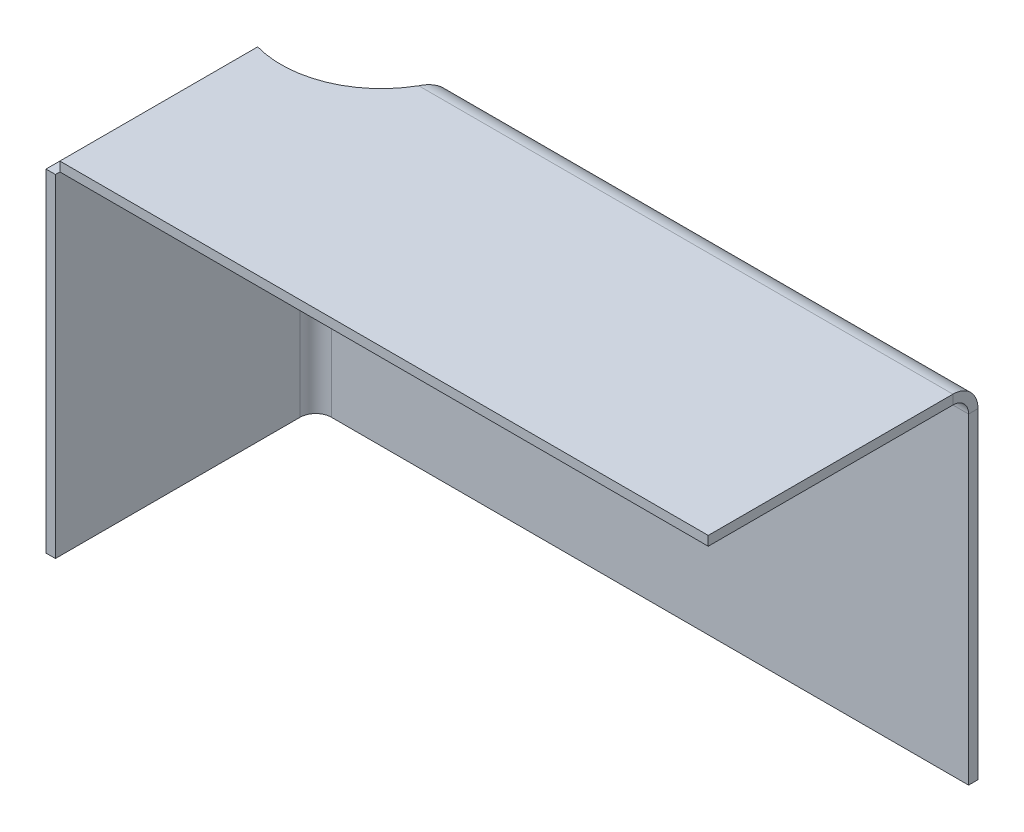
ISO-10303-21;
HEADER;
FILE_DESCRIPTION(('STEP AP214'),'2;1');
FILE_NAME('part.step','',(''),(''),'','','');
FILE_SCHEMA(('AUTOMOTIVE_DESIGN { 1 0 10303 214 1 1 1 1 }'));
ENDSEC;
DATA;
#1=APPLICATION_CONTEXT('core data for automotive mechanical design processes');
#2=APPLICATION_PROTOCOL_DEFINITION('international standard','automotive_design',2000,#1);
#3=PRODUCT_CONTEXT('',#1,'mechanical');
#4=PRODUCT('Part','Part','',(#3));
#5=PRODUCT_RELATED_PRODUCT_CATEGORY('part','',(#4));
#6=PRODUCT_DEFINITION_FORMATION('','',#4);
#7=PRODUCT_DEFINITION_CONTEXT('part definition',#1,'design');
#8=PRODUCT_DEFINITION('design','',#6,#7);
#9=PRODUCT_DEFINITION_SHAPE('','',#8);
#10=(LENGTH_UNIT() NAMED_UNIT(*) SI_UNIT(.MILLI.,.METRE.));
#11=(NAMED_UNIT(*) PLANE_ANGLE_UNIT() SI_UNIT($,.RADIAN.));
#12=(NAMED_UNIT(*) SI_UNIT($,.STERADIAN.) SOLID_ANGLE_UNIT());
#13=UNCERTAINTY_MEASURE_WITH_UNIT(LENGTH_MEASURE(1.E-05),#10,'distance_accuracy_value','');
#14=(GEOMETRIC_REPRESENTATION_CONTEXT(3) GLOBAL_UNCERTAINTY_ASSIGNED_CONTEXT((#13)) GLOBAL_UNIT_ASSIGNED_CONTEXT((#10,
#11,#12)) REPRESENTATION_CONTEXT('',''));
#15=CARTESIAN_POINT('',(0.,0.,0.));
#16=DIRECTION('',(0.,0.,1.));
#17=DIRECTION('',(1.,0.,0.));
#18=AXIS2_PLACEMENT_3D('',#15,#16,#17);
#19=CARTESIAN_POINT('',(52.0320345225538,-26.8636569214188,1.5));
#20=DIRECTION('',(0.,0.,1.));
#21=DIRECTION('',(1.,0.,0.));
#22=AXIS2_PLACEMENT_3D('',#19,#20,#21);
#23=PLANE('',#22);
#24=CARTESIAN_POINT('',(-47.006738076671,21.5302542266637,1.5));
#25=DIRECTION('',(0.,0.,1.));
#26=DIRECTION('',(1.,0.,0.));
#27=AXIS2_PLACEMENT_3D('',#24,#25,#26);
#28=CIRCLE('',#27,16.);
#29=CARTESIAN_POINT('',(-49.5320345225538,5.73079607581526,1.49999996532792));
#30=VERTEX_POINT('',#29);
#31=CARTESIAN_POINT('',(-31.2596167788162,24.3636569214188,1.49999998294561));
#32=VERTEX_POINT('',#31);
#33=EDGE_CURVE('E338',#30,#32,#28,.T.);
#34=ORIENTED_EDGE('',*,*,#33,.F.);
#35=DIRECTION('',(0.,1.,0.));
#36=VECTOR('',#35,1.);
#37=CARTESIAN_POINT('',(-49.5320345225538,-26.8636569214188,1.5));
#38=LINE('',#37,#36);
#39=CARTESIAN_POINT('',(-49.5320345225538,-26.8636569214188,1.49999998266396));
#40=VERTEX_POINT('',#39);
#41=EDGE_CURVE('E461',#40,#30,#38,.T.);
#42=ORIENTED_EDGE('',*,*,#41,.F.);
#43=DIRECTION('',(1.,0.,0.));
#44=VECTOR('',#43,1.);
#45=CARTESIAN_POINT('',(-52.0320345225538,-26.8636569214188,1.5));
#46=LINE('',#45,#44);
#47=CARTESIAN_POINT('',(52.0320345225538,-26.8636569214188,1.5));
#48=VERTEX_POINT('',#47);
#49=EDGE_CURVE('E436',#40,#48,#46,.T.);
#50=ORIENTED_EDGE('',*,*,#49,.T.);
#51=DIRECTION('',(0.,1.,0.));
#52=VECTOR('',#51,1.);
#53=CARTESIAN_POINT('',(52.0320345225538,26.8636569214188,1.5));
#54=LINE('',#53,#52);
#55=CARTESIAN_POINT('',(52.0320345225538,24.3636569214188,1.5));
#56=VERTEX_POINT('',#55);
#57=EDGE_CURVE('E429',#48,#56,#54,.T.);
#58=ORIENTED_EDGE('',*,*,#57,.T.);
#59=DIRECTION('',(1.,0.,0.));
#60=VECTOR('',#59,1.);
#61=CARTESIAN_POINT('',(-51.3249277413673,24.3636569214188,1.5));
#62=LINE('',#61,#60);
#63=EDGE_CURVE('E445',#32,#56,#62,.T.);
#64=ORIENTED_EDGE('',*,*,#63,.F.);
#65=EDGE_LOOP('',(#34,#42,#50,#58,#64));
#66=FACE_BOUND('',#65,.T.);
#67=ADVANCED_FACE('F61',(#66),#23,.T.);
#68=CARTESIAN_POINT('',(52.0320345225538,-26.8636569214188,0.));
#69=DIRECTION('',(0.,0.,1.));
#70=DIRECTION('',(1.,0.,0.));
#71=AXIS2_PLACEMENT_3D('',#68,#69,#70);
#72=PLANE('',#71);
#73=DIRECTION('',(0.,1.,0.));
#74=VECTOR('',#73,1.);
#75=CARTESIAN_POINT('',(-49.5320345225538,-26.8636569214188,0.));
#76=LINE('',#75,#74);
#77=CARTESIAN_POINT('',(-49.5320345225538,-26.8636569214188,0.));
#78=VERTEX_POINT('',#77);
#79=CARTESIAN_POINT('',(-49.5320345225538,5.73079607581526,-3.46720829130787E-08));
#80=VERTEX_POINT('',#79);
#81=EDGE_CURVE('E71',#78,#80,#76,.T.);
#82=ORIENTED_EDGE('',*,*,#81,.T.);
#83=CARTESIAN_POINT('',(-47.006738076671,21.5302542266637,0.));
#84=DIRECTION('',(0.,0.,1.));
#85=DIRECTION('',(1.,0.,0.));
#86=AXIS2_PLACEMENT_3D('',#83,#84,#85);
#87=CIRCLE('',#86,16.);
#88=CARTESIAN_POINT('',(-31.2596167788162,24.3636569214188,0.));
#89=VERTEX_POINT('',#88);
#90=EDGE_CURVE('E85',#80,#89,#87,.T.);
#91=ORIENTED_EDGE('',*,*,#90,.T.);
#92=DIRECTION('',(1.,0.,0.));
#93=VECTOR('',#92,1.);
#94=CARTESIAN_POINT('',(-51.3249277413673,24.3636569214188,0.));
#95=LINE('',#94,#93);
#96=CARTESIAN_POINT('',(52.0320345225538,24.3636569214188,0.));
#97=VERTEX_POINT('',#96);
#98=EDGE_CURVE('E449',#89,#97,#95,.T.);
#99=ORIENTED_EDGE('',*,*,#98,.T.);
#100=DIRECTION('',(0.,1.,0.));
#101=VECTOR('',#100,1.);
#102=CARTESIAN_POINT('',(52.0320345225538,26.8636569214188,0.));
#103=LINE('',#102,#101);
#104=CARTESIAN_POINT('',(52.0320345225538,-26.8636569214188,0.));
#105=VERTEX_POINT('',#104);
#106=EDGE_CURVE('E440',#105,#97,#103,.T.);
#107=ORIENTED_EDGE('',*,*,#106,.F.);
#108=DIRECTION('',(1.,0.,0.));
#109=VECTOR('',#108,1.);
#110=CARTESIAN_POINT('',(-52.0320345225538,-26.8636569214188,0.));
#111=LINE('',#110,#109);
#112=EDGE_CURVE('E437',#78,#105,#111,.T.);
#113=ORIENTED_EDGE('',*,*,#112,.F.);
#114=EDGE_LOOP('',(#82,#91,#99,#107,#113));
#115=FACE_BOUND('',#114,.T.);
#116=ADVANCED_FACE('F515',(#115),#72,.F.);
#117=CARTESIAN_POINT('',(-52.0320345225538,-26.8636569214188,1.5));
#118=DIRECTION('',(0.,1.,0.));
#119=DIRECTION('',(0.,0.,1.));
#120=AXIS2_PLACEMENT_3D('',#117,#118,#119);
#121=PLANE('',#120);
#122=DIRECTION('',(0.,0.,-1.));
#123=VECTOR('',#122,1.);
#124=CARTESIAN_POINT('',(-49.5320345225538,-26.8636569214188,1.5));
#125=LINE('',#124,#123);
#126=EDGE_CURVE('E12',#40,#78,#125,.T.);
#127=ORIENTED_EDGE('',*,*,#126,.T.);
#128=ORIENTED_EDGE('',*,*,#112,.T.);
#129=DIRECTION('',(0.,0.,-1.));
#130=VECTOR('',#129,1.);
#131=CARTESIAN_POINT('',(52.0320345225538,-26.8636569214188,1.5));
#132=LINE('',#131,#130);
#133=EDGE_CURVE('E439',#48,#105,#132,.T.);
#134=ORIENTED_EDGE('',*,*,#133,.F.);
#135=ORIENTED_EDGE('',*,*,#49,.F.);
#136=EDGE_LOOP('',(#127,#128,#134,#135));
#137=FACE_BOUND('',#136,.T.);
#138=ADVANCED_FACE('F520',(#137),#121,.F.);
#139=CARTESIAN_POINT('',(52.0320345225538,26.8636569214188,1.5));
#140=DIRECTION('',(-1.,0.,0.));
#141=DIRECTION('',(0.,0.,1.));
#142=AXIS2_PLACEMENT_3D('',#139,#140,#141);
#143=PLANE('',#142);
#144=DIRECTION('',(0.,0.,-1.));
#145=VECTOR('',#144,1.);
#146=CARTESIAN_POINT('',(52.0320345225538,24.3636569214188,1.5));
#147=LINE('',#146,#145);
#148=EDGE_CURVE('E446',#56,#97,#147,.T.);
#149=ORIENTED_EDGE('',*,*,#148,.F.);
#150=ORIENTED_EDGE('',*,*,#57,.F.);
#151=ORIENTED_EDGE('',*,*,#133,.T.);
#152=ORIENTED_EDGE('',*,*,#106,.T.);
#153=EDGE_LOOP('',(#149,#150,#151,#152));
#154=FACE_BOUND('',#153,.T.);
#155=ADVANCED_FACE('F539',(#154),#143,.F.);
#156=CARTESIAN_POINT('',(-47.006738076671,21.5302542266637,1.5));
#157=DIRECTION('',(0.,0.,1.));
#158=DIRECTION('',(1.,0.,0.));
#159=AXIS2_PLACEMENT_3D('',#156,#157,#158);
#160=CYLINDRICAL_SURFACE('',#159,16.);
#161=CARTESIAN_POINT('',(-49.5320345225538,5.73079607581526,1.49999996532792));
#162=CARTESIAN_POINT('',(-49.5320345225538,5.73079607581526,-3.46720831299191E-08));
#163=B_SPLINE_CURVE_WITH_KNOTS('',1,(#161,#162),.UNSPECIFIED.,.F.,.F.,(2,2),(0.,1.),.UNSPECIFIED.);
#164=EDGE_CURVE('E295',#30,#80,#163,.T.);
#165=ORIENTED_EDGE('',*,*,#164,.F.);
#166=ORIENTED_EDGE('',*,*,#33,.T.);
#167=CARTESIAN_POINT('',(-31.2596167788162,24.3636569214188,-1.70543941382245E-08));
#168=CARTESIAN_POINT('',(-31.2596167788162,24.3636569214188,1.49999998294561));
#169=B_SPLINE_CURVE_WITH_KNOTS('',1,(#167,#168),.UNSPECIFIED.,.F.,.F.,(2,2),(0.,1.),.UNSPECIFIED.);
#170=EDGE_CURVE('E463',#89,#32,#169,.T.);
#171=ORIENTED_EDGE('',*,*,#170,.F.);
#172=ORIENTED_EDGE('',*,*,#90,.F.);
#173=EDGE_LOOP('',(#165,#166,#171,#172));
#174=FACE_BOUND('',#173,.T.);
#175=ADVANCED_FACE('F63',(#174),#160,.F.);
#176=CARTESIAN_POINT('',(-33.1150008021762,28.3636569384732,4.00000000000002));
#177=CARTESIAN_POINT('',(-32.8953184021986,28.3636569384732,3.51950268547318));
#178=CARTESIAN_POINT('',(-32.6913049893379,28.2759946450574,3.02954129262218));
#179=CARTESIAN_POINT('',(-32.4090473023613,28.0078314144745,2.33205620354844));
#180=CARTESIAN_POINT('',(-32.318907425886,27.8958618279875,2.10585699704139));
#181=CARTESIAN_POINT('',(-32.2111651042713,27.7287667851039,1.83665737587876));
#182=CARTESIAN_POINT('',(-32.1898632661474,27.6939957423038,1.78349512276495));
#183=CARTESIAN_POINT('',(-32.1582804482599,27.6398456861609,1.70487474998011));
#184=CARTESIAN_POINT('',(-32.1478144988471,27.6214634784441,1.67885512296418));
#185=CARTESIAN_POINT('',(-32.1348091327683,27.5980745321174,1.64657559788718));
#186=CARTESIAN_POINT('',(-32.132211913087,27.5933761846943,1.64013194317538));
#187=CARTESIAN_POINT('',(-32.1270251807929,27.5839384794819,1.62726941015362));
#188=CARTESIAN_POINT('',(-32.1243220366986,27.5789878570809,1.62057204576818));
#189=CARTESIAN_POINT('',(-32.1189777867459,27.5691498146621,1.60731603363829));
#190=CARTESIAN_POINT('',(-32.1154097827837,27.5625054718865,1.59843949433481));
#191=CARTESIAN_POINT('',(-32.0832512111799,27.5019227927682,1.51821172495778));
#192=CARTESIAN_POINT('',(-32.0543348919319,27.4424982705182,1.44447247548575));
#193=CARTESIAN_POINT('',(-31.9665931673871,27.2453379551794,1.21865968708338));
#194=CARTESIAN_POINT('',(-31.9067749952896,27.0886162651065,1.06176795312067));
#195=CARTESIAN_POINT('',(-31.7844912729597,26.7143549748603,0.75456787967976));
#196=CARTESIAN_POINT('',(-31.7220257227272,26.4966751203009,0.604254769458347));
#197=CARTESIAN_POINT('',(-31.5944472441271,25.9948716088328,0.336669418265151));
#198=CARTESIAN_POINT('',(-31.5293343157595,25.7105764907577,0.219461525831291));
#199=CARTESIAN_POINT('',(-31.3964610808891,25.0794755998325,0.0510422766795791));
#200=CARTESIAN_POINT('',(-31.3287500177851,24.7327617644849,-1.7054394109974E-08));
#201=CARTESIAN_POINT('',(-31.2596167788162,24.3636569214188,-1.70543941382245E-08));
#202=CARTESIAN_POINT('',(-33.1150008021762,26.8636569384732,4.00000000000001));
#203=CARTESIAN_POINT('',(-32.8953061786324,26.8636569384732,3.69967246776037));
#204=CARTESIAN_POINT('',(-32.6913049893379,26.8088680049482,3.39346330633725));
#205=CARTESIAN_POINT('',(-32.4090473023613,26.6412659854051,2.95753512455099));
#206=CARTESIAN_POINT('',(-32.318907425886,26.5712849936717,2.81616062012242));
#207=CARTESIAN_POINT('',(-32.2111651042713,26.4668505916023,2.64791085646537));
#208=CARTESIAN_POINT('',(-32.1898632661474,26.4451186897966,2.61468444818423));
#209=CARTESIAN_POINT('',(-32.1582804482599,26.4112749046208,2.56554671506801));
#210=CARTESIAN_POINT('',(-32.1478144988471,26.3997860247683,2.54928444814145));
#211=CARTESIAN_POINT('',(-32.1348091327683,26.3851679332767,2.52910974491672));
#212=CARTESIAN_POINT('',(-32.132211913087,26.3822314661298,2.52508246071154));
#213=CARTESIAN_POINT('',(-32.1270251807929,26.376332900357,2.51704337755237));
#214=CARTESIAN_POINT('',(-32.1243220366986,26.3732387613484,2.51285752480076));
#215=CARTESIAN_POINT('',(-32.1189777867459,26.367089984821,2.50457251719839));
#216=CARTESIAN_POINT('',(-32.1154097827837,26.3629372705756,2.49902468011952));
#217=CARTESIAN_POINT('',(-32.0832512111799,26.3250730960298,2.44888232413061));
#218=CARTESIAN_POINT('',(-32.0543348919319,26.2879327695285,2.40279529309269));
#219=CARTESIAN_POINT('',(-31.9665931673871,26.1647075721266,2.26166229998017));
#220=CARTESIAN_POINT('',(-31.9067749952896,26.0667565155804,2.16360496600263));
#221=CARTESIAN_POINT('',(-31.7844912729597,25.8328432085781,1.97160491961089));
#222=CARTESIAN_POINT('',(-31.7220257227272,25.6967932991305,1.87765922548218));
#223=CARTESIAN_POINT('',(-31.5944472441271,25.3831661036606,1.71041838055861));
#224=CARTESIAN_POINT('',(-31.5293343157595,25.2054816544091,1.63716344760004));
#225=CARTESIAN_POINT('',(-31.3964610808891,24.8110435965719,1.53190141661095));
#226=CARTESIAN_POINT('',(-31.3287475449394,24.5943391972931,1.49999998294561));
#227=CARTESIAN_POINT('',(-31.2596167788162,24.3636569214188,1.49999998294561));
#228=B_SPLINE_SURFACE_WITH_KNOTS('',1,3,((#176,#177,#178,#179,#180,#181,#182,#183,#184,#185,
#186,#187,#188,#189,#190,#191,#192,#193,#194,#195,#196,#197,#198,#199,#200,#201),(#202,#203,
#204,#205,#206,#207,#208,#209,#210,#211,#212,#213,#214,#215,#216,#217,#218,#219,#220,#221,#222,
#223,#224,#225,#226,#227)),.UNSPECIFIED.,.F.,.F.,.F.,(2,2),(4,2,2,2,2,2,2,2,2,2,2,2,4),(0.,1.),
(0.,0.25,0.375,0.40625,0.421875,0.42578125,0.4296875,0.4375,0.5,0.625,0.75,0.875,1.),.UNSPECIFIED.);
#229=CARTESIAN_POINT('',(-33.1150008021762,26.8636569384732,4.00000000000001));
#230=CARTESIAN_POINT('',(-33.1150008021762,28.3636569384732,4.00000000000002));
#231=B_SPLINE_CURVE_WITH_KNOTS('',1,(#229,#230),.UNSPECIFIED.,.F.,.F.,(2,2),(0.,1.),.UNSPECIFIED.);
#232=CARTESIAN_POINT('',(-33.1150008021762,26.8636569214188,4.00000000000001));
#233=VERTEX_POINT('',#232);
#234=CARTESIAN_POINT('',(-33.1150008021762,28.3636569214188,4.));
#235=VERTEX_POINT('',#234);
#236=EDGE_CURVE('E425',#233,#235,#231,.T.);
#237=CARTESIAN_POINT('',(-33.1150008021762,28.3636569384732,4.00000000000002));
#238=CARTESIAN_POINT('',(-32.8953184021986,28.3636569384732,3.51950268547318));
#239=CARTESIAN_POINT('',(-32.6913049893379,28.2759946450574,3.02954129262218));
#240=CARTESIAN_POINT('',(-32.4090473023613,28.0078314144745,2.33205620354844));
#241=CARTESIAN_POINT('',(-32.318907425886,27.8958618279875,2.10585699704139));
#242=CARTESIAN_POINT('',(-32.2111651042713,27.7287667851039,1.83665737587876));
#243=CARTESIAN_POINT('',(-32.1898632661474,27.6939957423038,1.78349512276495));
#244=CARTESIAN_POINT('',(-32.1582804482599,27.6398456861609,1.70487474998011));
#245=CARTESIAN_POINT('',(-32.1478144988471,27.6214634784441,1.67885512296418));
#246=CARTESIAN_POINT('',(-32.1348091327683,27.5980745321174,1.64657559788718));
#247=CARTESIAN_POINT('',(-32.132211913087,27.5933761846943,1.64013194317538));
#248=CARTESIAN_POINT('',(-32.1270251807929,27.5839384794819,1.62726941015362));
#249=CARTESIAN_POINT('',(-32.1243220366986,27.5789878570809,1.62057204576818));
#250=CARTESIAN_POINT('',(-32.1189777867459,27.5691498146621,1.60731603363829));
#251=CARTESIAN_POINT('',(-32.1154097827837,27.5625054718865,1.59843949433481));
#252=CARTESIAN_POINT('',(-32.0832512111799,27.5019227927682,1.51821172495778));
#253=CARTESIAN_POINT('',(-32.0543348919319,27.4424982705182,1.44447247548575));
#254=CARTESIAN_POINT('',(-31.9665931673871,27.2453379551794,1.21865968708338));
#255=CARTESIAN_POINT('',(-31.9067749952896,27.0886162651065,1.06176795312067));
#256=CARTESIAN_POINT('',(-31.7844912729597,26.7143549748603,0.75456787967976));
#257=CARTESIAN_POINT('',(-31.7220257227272,26.4966751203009,0.604254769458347));
#258=CARTESIAN_POINT('',(-31.5944472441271,25.9948716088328,0.336669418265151));
#259=CARTESIAN_POINT('',(-31.5293343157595,25.7105764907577,0.219461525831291));
#260=CARTESIAN_POINT('',(-31.3964610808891,25.0794755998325,0.0510422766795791));
#261=CARTESIAN_POINT('',(-31.3287500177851,24.7327617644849,-1.7054394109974E-08));
#262=CARTESIAN_POINT('',(-31.2596167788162,24.3636569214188,-1.70543941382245E-08));
#263=B_SPLINE_CURVE_WITH_KNOTS('',3,(#237,#238,#239,#240,#241,#242,#243,#244,#245,#246,#247,
#248,#249,#250,#251,#252,#253,#254,#255,#256,#257,#258,#259,#260,#261,#262),.UNSPECIFIED.,.F.,
.F.,(4,2,2,2,2,2,2,2,2,2,2,2,4),(0.,0.25,0.375,0.40625,0.421875,0.42578125,0.4296875,0.4375,0.5,
0.625,0.75,0.875,1.),.UNSPECIFIED.);
#264=EDGE_CURVE('E343',#235,#89,#263,.T.);
#265=CARTESIAN_POINT('',(-31.2596167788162,24.3636569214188,1.49999998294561));
#266=CARTESIAN_POINT('',(-31.3287475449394,24.5943391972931,1.49999998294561));
#267=CARTESIAN_POINT('',(-31.3964610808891,24.8110435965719,1.53190141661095));
#268=CARTESIAN_POINT('',(-31.5293343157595,25.2054816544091,1.63716344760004));
#269=CARTESIAN_POINT('',(-31.5944472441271,25.3831661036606,1.71041838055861));
#270=CARTESIAN_POINT('',(-31.7220257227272,25.6967932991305,1.87765922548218));
#271=CARTESIAN_POINT('',(-31.7844912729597,25.8328432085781,1.97160491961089));
#272=CARTESIAN_POINT('',(-31.9067749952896,26.0667565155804,2.16360496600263));
#273=CARTESIAN_POINT('',(-31.9665931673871,26.1647075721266,2.26166229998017));
#274=CARTESIAN_POINT('',(-32.0543348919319,26.2879327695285,2.40279529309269));
#275=CARTESIAN_POINT('',(-32.0832512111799,26.3250730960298,2.44888232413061));
#276=CARTESIAN_POINT('',(-32.1154097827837,26.3629372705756,2.49902468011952));
#277=CARTESIAN_POINT('',(-32.1189777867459,26.367089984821,2.50457251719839));
#278=CARTESIAN_POINT('',(-32.1243220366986,26.3732387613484,2.51285752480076));
#279=CARTESIAN_POINT('',(-32.1270251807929,26.376332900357,2.51704337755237));
#280=CARTESIAN_POINT('',(-32.132211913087,26.3822314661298,2.52508246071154));
#281=CARTESIAN_POINT('',(-32.1348091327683,26.3851679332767,2.52910974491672));
#282=CARTESIAN_POINT('',(-32.1478144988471,26.3997860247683,2.54928444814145));
#283=CARTESIAN_POINT('',(-32.1582804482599,26.4112749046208,2.56554671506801));
#284=CARTESIAN_POINT('',(-32.1898632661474,26.4451186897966,2.61468444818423));
#285=CARTESIAN_POINT('',(-32.2111651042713,26.4668505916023,2.64791085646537));
#286=CARTESIAN_POINT('',(-32.318907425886,26.5712849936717,2.81616062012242));
#287=CARTESIAN_POINT('',(-32.4090473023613,26.6412659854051,2.95753512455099));
#288=CARTESIAN_POINT('',(-32.6913049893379,26.8088680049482,3.39346330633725));
#289=CARTESIAN_POINT('',(-32.8953061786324,26.8636569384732,3.69967246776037));
#290=CARTESIAN_POINT('',(-33.1150008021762,26.8636569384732,4.00000000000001));
#291=B_SPLINE_CURVE_WITH_KNOTS('',3,(#265,#266,#267,#268,#269,#270,#271,#272,#273,#274,#275,
#276,#277,#278,#279,#280,#281,#282,#283,#284,#285,#286,#287,#288,#289,#290),.UNSPECIFIED.,.F.,
.F.,(4,2,2,2,2,2,2,2,2,2,2,2,4),(0.,0.125,0.25,0.375,0.5,0.5625,0.5703125,0.57421875,0.578125,
0.59375,0.625,0.75,1.),.UNSPECIFIED.);
#292=EDGE_CURVE('E339',#233,#32,#291,.F.);
#293=ORIENTED_EDGE('',*,*,#236,.T.);
#294=ORIENTED_EDGE('',*,*,#264,.T.);
#295=ORIENTED_EDGE('',*,*,#170,.T.);
#296=ORIENTED_EDGE('',*,*,#292,.F.);
#297=EDGE_LOOP('',(#293,#294,#295,#296));
#298=FACE_BOUND('',#297,.T.);
#299=ADVANCED_FACE('F391',(#298),#228,.F.);
#300=CARTESIAN_POINT('',(52.0320345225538,24.3636569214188,4.00000001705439));
#301=DIRECTION('',(-1.,0.,0.));
#302=DIRECTION('',(0.,0.,1.));
#303=AXIS2_PLACEMENT_3D('',#300,#301,#302);
#304=PLANE('',#303);
#305=ORIENTED_EDGE('',*,*,#148,.T.);
#306=CARTESIAN_POINT('',(52.0320345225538,24.3636569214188,4.));
#307=DIRECTION('',(-1.,0.,0.));
#308=DIRECTION('',(0.,0.,1.));
#309=AXIS2_PLACEMENT_3D('',#306,#307,#308);
#310=CIRCLE('',#309,4.00000001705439);
#311=CARTESIAN_POINT('',(52.0320345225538,28.3636569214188,4.));
#312=VERTEX_POINT('',#311);
#313=EDGE_CURVE('E340',#97,#312,#310,.F.);
#314=ORIENTED_EDGE('',*,*,#313,.T.);
#315=DIRECTION('',(0.,1.,0.));
#316=VECTOR('',#315,1.);
#317=CARTESIAN_POINT('',(52.0320345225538,26.8636569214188,4.00000000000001));
#318=LINE('',#317,#316);
#319=CARTESIAN_POINT('',(52.0320345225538,26.8636569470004,4.00000000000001));
#320=VERTEX_POINT('',#319);
#321=EDGE_CURVE('E319',#320,#312,#318,.T.);
#322=ORIENTED_EDGE('',*,*,#321,.F.);
#323=CARTESIAN_POINT('',(52.0320345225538,24.3636569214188,4.00000001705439));
#324=DIRECTION('',(1.,0.,0.));
#325=DIRECTION('',(0.,0.,-1.));
#326=AXIS2_PLACEMENT_3D('',#323,#324,#325);
#327=CIRCLE('',#326,2.50000002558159);
#328=EDGE_CURVE('E335',#56,#320,#327,.T.);
#329=ORIENTED_EDGE('',*,*,#328,.F.);
#330=EDGE_LOOP('',(#305,#314,#322,#329));
#331=FACE_BOUND('',#330,.T.);
#332=ADVANCED_FACE('F361',(#331),#304,.F.);
#333=CARTESIAN_POINT('',(95.6993353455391,24.3636569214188,4.));
#334=DIRECTION('',(-1.,0.,0.));
#335=DIRECTION('',(0.,0.,1.));
#336=AXIS2_PLACEMENT_3D('',#333,#334,#335);
#337=CYLINDRICAL_SURFACE('',#336,2.50000001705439);
#338=ORIENTED_EDGE('',*,*,#328,.T.);
#339=DIRECTION('',(-1.,0.,0.));
#340=VECTOR('',#339,1.);
#341=CARTESIAN_POINT('',(52.0320345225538,26.8636569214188,4.00000000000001));
#342=LINE('',#341,#340);
#343=EDGE_CURVE('E213',#320,#233,#342,.T.);
#344=ORIENTED_EDGE('',*,*,#343,.T.);
#345=ORIENTED_EDGE('',*,*,#292,.T.);
#346=ORIENTED_EDGE('',*,*,#63,.T.);
#347=EDGE_LOOP('',(#338,#344,#345,#346));
#348=FACE_BOUND('',#347,.T.);
#349=ADVANCED_FACE('F350',(#348),#337,.F.);
#350=CARTESIAN_POINT('',(95.6993353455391,24.3636569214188,4.));
#351=DIRECTION('',(-1.,0.,0.));
#352=DIRECTION('',(0.,0.,1.));
#353=AXIS2_PLACEMENT_3D('',#350,#351,#352);
#354=CYLINDRICAL_SURFACE('',#353,4.00000001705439);
#355=ORIENTED_EDGE('',*,*,#313,.F.);
#356=ORIENTED_EDGE('',*,*,#98,.F.);
#357=ORIENTED_EDGE('',*,*,#264,.F.);
#358=DIRECTION('',(1.,0.,0.));
#359=VECTOR('',#358,1.);
#360=CARTESIAN_POINT('',(52.0320345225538,28.3636569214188,4.));
#361=LINE('',#360,#359);
#362=EDGE_CURVE('E334',#235,#312,#361,.T.);
#363=ORIENTED_EDGE('',*,*,#362,.T.);
#364=EDGE_LOOP('',(#355,#356,#357,#363));
#365=FACE_BOUND('',#364,.T.);
#366=ADVANCED_FACE('F360',(#365),#354,.T.);
#367=CARTESIAN_POINT('',(-51.3249277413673,26.8636569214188,1.50000000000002));
#368=DIRECTION('',(1.,0.,0.));
#369=DIRECTION('',(0.,0.,-1.));
#370=AXIS2_PLACEMENT_3D('',#367,#368,#369);
#371=PLANE('',#370);
#372=DIRECTION('',(0.,0.,1.));
#373=VECTOR('',#372,1.);
#374=CARTESIAN_POINT('',(-51.3249277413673,28.3636569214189,43.));
#375=LINE('',#374,#373);
#376=CARTESIAN_POINT('',(-51.3249277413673,28.3636569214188,11.4677819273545));
#377=VERTEX_POINT('',#376);
#378=CARTESIAN_POINT('',(-51.3249277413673,28.3636569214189,43.));
#379=VERTEX_POINT('',#378);
#380=EDGE_CURVE('E309',#377,#379,#375,.T.);
#381=ORIENTED_EDGE('',*,*,#380,.F.);
#382=DIRECTION('',(0.,-1.,0.));
#383=VECTOR('',#382,1.);
#384=CARTESIAN_POINT('',(-51.3249277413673,26.8636569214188,11.4677819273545));
#385=LINE('',#384,#383);
#386=CARTESIAN_POINT('',(-51.3249277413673,26.8636569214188,11.4677819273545));
#387=VERTEX_POINT('',#386);
#388=EDGE_CURVE('E329',#377,#387,#385,.T.);
#389=ORIENTED_EDGE('',*,*,#388,.T.);
#390=DIRECTION('',(0.,0.,1.));
#391=VECTOR('',#390,1.);
#392=CARTESIAN_POINT('',(-51.3249277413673,26.8636569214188,1.50000000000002));
#393=LINE('',#392,#391);
#394=CARTESIAN_POINT('',(-51.3249277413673,26.8636569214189,43.));
#395=VERTEX_POINT('',#394);
#396=EDGE_CURVE('E327',#387,#395,#393,.T.);
#397=ORIENTED_EDGE('',*,*,#396,.T.);
#398=DIRECTION('',(0.,-1.,0.));
#399=VECTOR('',#398,1.);
#400=CARTESIAN_POINT('',(-51.3249277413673,28.3636569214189,43.));
#401=LINE('',#400,#399);
#402=EDGE_CURVE('E324',#379,#395,#401,.T.);
#403=ORIENTED_EDGE('',*,*,#402,.F.);
#404=EDGE_LOOP('',(#381,#389,#397,#403));
#405=FACE_BOUND('',#404,.T.);
#406=ADVANCED_FACE('F271',(#405),#371,.F.);
#407=CARTESIAN_POINT('',(52.0320345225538,28.3636569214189,43.));
#408=DIRECTION('',(0.,0.,-1.));
#409=DIRECTION('',(0.,1.,0.));
#410=AXIS2_PLACEMENT_3D('',#407,#408,#409);
#411=PLANE('',#410);
#412=DIRECTION('',(1.,0.,0.));
#413=VECTOR('',#412,1.);
#414=CARTESIAN_POINT('',(52.0320345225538,28.3636569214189,43.));
#415=LINE('',#414,#413);
#416=CARTESIAN_POINT('',(52.0320345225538,28.3636569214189,43.));
#417=VERTEX_POINT('',#416);
#418=EDGE_CURVE('E307',#379,#417,#415,.T.);
#419=ORIENTED_EDGE('',*,*,#418,.F.);
#420=ORIENTED_EDGE('',*,*,#402,.T.);
#421=DIRECTION('',(1.,0.,0.));
#422=VECTOR('',#421,1.);
#423=CARTESIAN_POINT('',(52.0320345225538,26.8636569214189,43.));
#424=LINE('',#423,#422);
#425=CARTESIAN_POINT('',(52.0320345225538,26.8636569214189,43.));
#426=VERTEX_POINT('',#425);
#427=EDGE_CURVE('E322',#395,#426,#424,.T.);
#428=ORIENTED_EDGE('',*,*,#427,.T.);
#429=DIRECTION('',(0.,-1.,0.));
#430=VECTOR('',#429,1.);
#431=CARTESIAN_POINT('',(52.0320345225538,28.3636569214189,43.));
#432=LINE('',#431,#430);
#433=EDGE_CURVE('E316',#417,#426,#432,.T.);
#434=ORIENTED_EDGE('',*,*,#433,.F.);
#435=EDGE_LOOP('',(#419,#420,#428,#434));
#436=FACE_BOUND('',#435,.T.);
#437=ADVANCED_FACE('F580',(#436),#411,.F.);
#438=CARTESIAN_POINT('',(52.0320345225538,26.8636569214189,43.));
#439=DIRECTION('',(0.,-1.,0.));
#440=DIRECTION('',(0.,0.,-1.));
#441=AXIS2_PLACEMENT_3D('',#438,#439,#440);
#442=PLANE('',#441);
#443=CARTESIAN_POINT('',(-47.006738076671,26.8636569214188,-3.93849075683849));
#444=DIRECTION('',(0.,-1.,0.));
#445=DIRECTION('',(1.,0.,0.));
#446=AXIS2_PLACEMENT_3D('',#443,#444,#445);
#447=CIRCLE('',#446,16.);
#448=EDGE_CURVE('E306',#233,#387,#447,.T.);
#449=ORIENTED_EDGE('',*,*,#448,.F.);
#450=ORIENTED_EDGE('',*,*,#343,.F.);
#451=DIRECTION('',(0.,0.,-1.));
#452=VECTOR('',#451,1.);
#453=CARTESIAN_POINT('',(52.0320345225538,26.8636569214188,1.50000000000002));
#454=LINE('',#453,#452);
#455=EDGE_CURVE('E314',#426,#320,#454,.T.);
#456=ORIENTED_EDGE('',*,*,#455,.F.);
#457=ORIENTED_EDGE('',*,*,#427,.F.);
#458=ORIENTED_EDGE('',*,*,#396,.F.);
#459=EDGE_LOOP('',(#449,#450,#456,#457,#458));
#460=FACE_BOUND('',#459,.T.);
#461=ADVANCED_FACE('F575',(#460),#442,.T.);
#462=CARTESIAN_POINT('',(52.0320345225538,28.3636569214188,1.50000000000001));
#463=DIRECTION('',(-1.,0.,0.));
#464=DIRECTION('',(0.,0.,1.));
#465=AXIS2_PLACEMENT_3D('',#462,#463,#464);
#466=PLANE('',#465);
#467=ORIENTED_EDGE('',*,*,#321,.T.);
#468=DIRECTION('',(0.,0.,-1.));
#469=VECTOR('',#468,1.);
#470=CARTESIAN_POINT('',(52.0320345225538,28.3636569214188,1.50000000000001));
#471=LINE('',#470,#469);
#472=EDGE_CURVE('E299',#417,#312,#471,.T.);
#473=ORIENTED_EDGE('',*,*,#472,.F.);
#474=ORIENTED_EDGE('',*,*,#433,.T.);
#475=ORIENTED_EDGE('',*,*,#455,.T.);
#476=EDGE_LOOP('',(#467,#473,#474,#475));
#477=FACE_BOUND('',#476,.T.);
#478=ADVANCED_FACE('F583',(#477),#466,.F.);
#479=CARTESIAN_POINT('',(52.0320345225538,28.3636569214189,43.));
#480=DIRECTION('',(0.,-1.,0.));
#481=DIRECTION('',(0.,0.,-1.));
#482=AXIS2_PLACEMENT_3D('',#479,#480,#481);
#483=PLANE('',#482);
#484=ORIENTED_EDGE('',*,*,#362,.F.);
#485=CARTESIAN_POINT('',(-47.006738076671,28.3636569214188,-3.93849075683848));
#486=DIRECTION('',(0.,-1.,0.));
#487=DIRECTION('',(0.,0.,-1.));
#488=AXIS2_PLACEMENT_3D('',#485,#486,#487);
#489=CIRCLE('',#488,16.);
#490=EDGE_CURVE('E311',#235,#377,#489,.T.);
#491=ORIENTED_EDGE('',*,*,#490,.T.);
#492=ORIENTED_EDGE('',*,*,#380,.T.);
#493=ORIENTED_EDGE('',*,*,#418,.T.);
#494=ORIENTED_EDGE('',*,*,#472,.T.);
#495=EDGE_LOOP('',(#484,#491,#492,#493,#494));
#496=FACE_BOUND('',#495,.T.);
#497=ADVANCED_FACE('F584',(#496),#483,.F.);
#498=CARTESIAN_POINT('',(-47.006738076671,26.8636569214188,-3.93849075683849));
#499=DIRECTION('',(0.,-1.,0.));
#500=DIRECTION('',(1.,0.,0.));
#501=AXIS2_PLACEMENT_3D('',#498,#499,#500);
#502=CYLINDRICAL_SURFACE('',#501,16.);
#503=ORIENTED_EDGE('',*,*,#236,.F.);
#504=ORIENTED_EDGE('',*,*,#448,.T.);
#505=ORIENTED_EDGE('',*,*,#388,.F.);
#506=ORIENTED_EDGE('',*,*,#490,.F.);
#507=EDGE_LOOP('',(#503,#504,#505,#506));
#508=FACE_BOUND('',#507,.T.);
#509=ADVANCED_FACE('F270',(#508),#502,.F.);
#510=CARTESIAN_POINT('',(-49.5320345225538,5.73079607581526,-3.46720831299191E-08));
#511=CARTESIAN_POINT('',(-50.1700260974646,5.81761270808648,-3.4672083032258E-08));
#512=CARTESIAN_POINT('',(-50.7562503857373,5.91616135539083,0.152610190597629));
#513=CARTESIAN_POINT('',(-51.4994080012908,6.08260498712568,0.506474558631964));
#514=CARTESIAN_POINT('',(-51.7248971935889,6.14113282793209,0.645138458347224));
#515=CARTESIAN_POINT('',(-52.0282134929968,6.2334945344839,0.871897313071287));
#516=CARTESIAN_POINT('',(-52.1235385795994,6.26504342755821,0.950624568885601));
#517=CARTESIAN_POINT('',(-52.2579664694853,6.31350925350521,1.07204146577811));
#518=CARTESIAN_POINT('',(-52.3013510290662,6.32985494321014,1.11306930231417));
#519=CARTESIAN_POINT('',(-52.3643201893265,6.35465909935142,1.17528252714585));
#520=CARTESIAN_POINT('',(-52.3849587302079,6.36297475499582,1.19613226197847));
#521=CARTESIAN_POINT('',(-52.4153943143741,6.37551964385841,1.22755537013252));
#522=CARTESIAN_POINT('',(-52.4254524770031,6.37971317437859,1.23805449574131));
#523=CARTESIAN_POINT('',(-52.4404097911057,6.38602132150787,1.25383793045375));
#524=CARTESIAN_POINT('',(-52.445373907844,6.38812701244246,1.25910486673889));
#525=CARTESIAN_POINT('',(-52.4527876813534,6.3912900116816,1.26701366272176));
#526=CARTESIAN_POINT('',(-52.4552535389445,6.39234508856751,1.26965132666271));
#527=CARTESIAN_POINT('',(-52.4601744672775,6.39445672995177,1.27492940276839));
#528=CARTESIAN_POINT('',(-52.4632191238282,6.39576776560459,1.27820562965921));
#529=CARTESIAN_POINT('',(-52.5841255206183,6.44795218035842,1.40859219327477));
#530=CARTESIAN_POINT('',(-52.7075483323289,6.50878741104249,1.55845899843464));
#531=CARTESIAN_POINT('',(-52.9479993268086,6.64936517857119,1.90806432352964));
#532=CARTESIAN_POINT('',(-53.0650294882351,6.72910771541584,2.1078946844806));
#533=CARTESIAN_POINT('',(-53.3763504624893,6.99669628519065,2.78768901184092));
#534=CARTESIAN_POINT('',(-53.5320345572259,7.2120525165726,3.35107665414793));
#535=CARTESIAN_POINT('',(-53.5320345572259,7.46692488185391,4.00000000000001));
#536=CARTESIAN_POINT('',(-49.5320345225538,5.73079607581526,1.49999996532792));
#537=CARTESIAN_POINT('',(-49.9307504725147,5.81760644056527,1.49999996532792));
#538=CARTESIAN_POINT('',(-50.2971694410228,5.91616135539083,1.59538135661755));
#539=CARTESIAN_POINT('',(-50.7616429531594,6.08260498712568,1.81654658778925));
#540=CARTESIAN_POINT('',(-50.9025736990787,6.14113282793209,1.90321152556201));
#541=CARTESIAN_POINT('',(-51.0921463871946,6.2334945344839,2.04493581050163));
#542=CARTESIAN_POINT('',(-51.151724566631,6.26504342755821,2.09414034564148));
#543=CARTESIAN_POINT('',(-51.2357419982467,6.31350925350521,2.17002590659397));
#544=CARTESIAN_POINT('',(-51.2628573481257,6.32985494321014,2.19566830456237));
#545=CARTESIAN_POINT('',(-51.3022130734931,6.35465909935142,2.23455157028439));
#546=CARTESIAN_POINT('',(-51.3151121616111,6.36297475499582,2.24758265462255));
#547=CARTESIAN_POINT('',(-51.3341344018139,6.37551964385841,2.26722209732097));
#548=CARTESIAN_POINT('',(-51.3404207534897,6.37971317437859,2.27378405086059));
#549=CARTESIAN_POINT('',(-51.3497690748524,6.38602132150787,2.28364869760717));
#550=CARTESIAN_POINT('',(-51.35287164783,6.38812701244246,2.2869405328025));
#551=CARTESIAN_POINT('',(-51.3575052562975,6.3912900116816,2.29188353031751));
#552=CARTESIAN_POINT('',(-51.3590464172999,6.39234508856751,2.29353207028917));
#553=CARTESIAN_POINT('',(-51.3621219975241,6.39445672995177,2.29683086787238));
#554=CARTESIAN_POINT('',(-51.3640249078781,6.39576776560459,2.29887850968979));
#555=CARTESIAN_POINT('',(-51.439591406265,6.44795218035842,2.38037011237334));
#556=CARTESIAN_POINT('',(-51.5167306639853,6.50878741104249,2.4740368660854));
#557=CARTESIAN_POINT('',(-51.6670125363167,6.64936517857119,2.69254019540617));
#558=CARTESIAN_POINT('',(-51.7401563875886,6.72910771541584,2.81743417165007));
#559=CARTESIAN_POINT('',(-51.9347319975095,6.99669628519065,3.24230562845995));
#560=CARTESIAN_POINT('',(-52.0320345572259,7.21219928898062,3.59465646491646));
#561=CARTESIAN_POINT('',(-52.0320345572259,7.46692488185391,4.));
#562=B_SPLINE_SURFACE_WITH_KNOTS('',1,3,((#510,#511,#512,#513,#514,#515,#516,#517,#518,#519,
#520,#521,#522,#523,#524,#525,#526,#527,#528,#529,#530,#531,#532,#533,#534,#535),(#536,#537,
#538,#539,#540,#541,#542,#543,#544,#545,#546,#547,#548,#549,#550,#551,#552,#553,#554,#555,#556,
#557,#558,#559,#560,#561)),.UNSPECIFIED.,.F.,.F.,.F.,(2,2),(4,2,2,2,2,2,2,2,2,2,2,2,4),(0.,1.),
(0.,0.25,0.375,0.4375,0.46875,0.484375,0.4921875,0.49609375,0.498046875,0.5,0.625,0.75,1.),.UNSPECIFIED.);
#563=CARTESIAN_POINT('',(-49.5320345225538,5.73079607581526,-3.46720831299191E-08));
#564=CARTESIAN_POINT('',(-50.1700260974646,5.81761270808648,-3.4672083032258E-08));
#565=CARTESIAN_POINT('',(-50.7562503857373,5.91616135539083,0.152610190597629));
#566=CARTESIAN_POINT('',(-51.4994080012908,6.08260498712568,0.506474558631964));
#567=CARTESIAN_POINT('',(-51.7248971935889,6.14113282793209,0.645138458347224));
#568=CARTESIAN_POINT('',(-52.0282134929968,6.2334945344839,0.871897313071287));
#569=CARTESIAN_POINT('',(-52.1235385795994,6.26504342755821,0.950624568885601));
#570=CARTESIAN_POINT('',(-52.2579664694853,6.31350925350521,1.07204146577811));
#571=CARTESIAN_POINT('',(-52.3013510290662,6.32985494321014,1.11306930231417));
#572=CARTESIAN_POINT('',(-52.3643201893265,6.35465909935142,1.17528252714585));
#573=CARTESIAN_POINT('',(-52.3849587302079,6.36297475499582,1.19613226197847));
#574=CARTESIAN_POINT('',(-52.4153943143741,6.37551964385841,1.22755537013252));
#575=CARTESIAN_POINT('',(-52.4254524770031,6.37971317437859,1.23805449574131));
#576=CARTESIAN_POINT('',(-52.4404097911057,6.38602132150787,1.25383793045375));
#577=CARTESIAN_POINT('',(-52.445373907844,6.38812701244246,1.25910486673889));
#578=CARTESIAN_POINT('',(-52.4527876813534,6.3912900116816,1.26701366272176));
#579=CARTESIAN_POINT('',(-52.4552535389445,6.39234508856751,1.26965132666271));
#580=CARTESIAN_POINT('',(-52.4601744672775,6.39445672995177,1.27492940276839));
#581=CARTESIAN_POINT('',(-52.4632191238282,6.39576776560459,1.27820562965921));
#582=CARTESIAN_POINT('',(-52.5841255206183,6.44795218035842,1.40859219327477));
#583=CARTESIAN_POINT('',(-52.7075483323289,6.50878741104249,1.55845899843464));
#584=CARTESIAN_POINT('',(-52.9479993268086,6.64936517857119,1.90806432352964));
#585=CARTESIAN_POINT('',(-53.0650294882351,6.72910771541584,2.1078946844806));
#586=CARTESIAN_POINT('',(-53.3763504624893,6.99669628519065,2.78768901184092));
#587=CARTESIAN_POINT('',(-53.5320345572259,7.2120525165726,3.35107665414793));
#588=CARTESIAN_POINT('',(-53.5320345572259,7.46692488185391,4.00000000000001));
#589=B_SPLINE_CURVE_WITH_KNOTS('',3,(#563,#564,#565,#566,#567,#568,#569,#570,#571,#572,#573,
#574,#575,#576,#577,#578,#579,#580,#581,#582,#583,#584,#585,#586,#587,#588),.UNSPECIFIED.,.F.,
.F.,(4,2,2,2,2,2,2,2,2,2,2,2,4),(0.,0.25,0.375,0.4375,0.46875,0.484375,0.4921875,0.49609375,
0.498046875,0.5,0.625,0.75,1.),.UNSPECIFIED.);
#590=CARTESIAN_POINT('',(-53.5320345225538,7.4669248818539,4.00000000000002));
#591=VERTEX_POINT('',#590);
#592=EDGE_CURVE('E184',#80,#591,#589,.T.);
#593=CARTESIAN_POINT('',(-53.5320345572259,7.46692488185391,4.00000000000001));
#594=CARTESIAN_POINT('',(-52.0320345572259,7.46692488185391,4.));
#595=B_SPLINE_CURVE_WITH_KNOTS('',1,(#593,#594),.UNSPECIFIED.,.F.,.F.,(2,2),(0.,1.),.UNSPECIFIED.);
#596=CARTESIAN_POINT('',(-52.0320345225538,7.4669248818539,4.00000000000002));
#597=VERTEX_POINT('',#596);
#598=EDGE_CURVE('E193',#591,#597,#595,.T.);
#599=CARTESIAN_POINT('',(-52.0320345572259,7.46692488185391,4.));
#600=CARTESIAN_POINT('',(-52.0320345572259,7.21219928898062,3.59465646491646));
#601=CARTESIAN_POINT('',(-51.9347319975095,6.99669628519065,3.24230562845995));
#602=CARTESIAN_POINT('',(-51.7401563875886,6.72910771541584,2.81743417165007));
#603=CARTESIAN_POINT('',(-51.6670125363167,6.64936517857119,2.69254019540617));
#604=CARTESIAN_POINT('',(-51.5167306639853,6.50878741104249,2.4740368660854));
#605=CARTESIAN_POINT('',(-51.439591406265,6.44795218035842,2.38037011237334));
#606=CARTESIAN_POINT('',(-51.3640249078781,6.39576776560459,2.29887850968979));
#607=CARTESIAN_POINT('',(-51.3621219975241,6.39445672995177,2.29683086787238));
#608=CARTESIAN_POINT('',(-51.3590464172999,6.39234508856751,2.29353207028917));
#609=CARTESIAN_POINT('',(-51.3575052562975,6.3912900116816,2.29188353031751));
#610=CARTESIAN_POINT('',(-51.35287164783,6.38812701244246,2.2869405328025));
#611=CARTESIAN_POINT('',(-51.3497690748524,6.38602132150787,2.28364869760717));
#612=CARTESIAN_POINT('',(-51.3404207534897,6.37971317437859,2.27378405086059));
#613=CARTESIAN_POINT('',(-51.3341344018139,6.37551964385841,2.26722209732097));
#614=CARTESIAN_POINT('',(-51.3151121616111,6.36297475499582,2.24758265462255));
#615=CARTESIAN_POINT('',(-51.3022130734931,6.35465909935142,2.23455157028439));
#616=CARTESIAN_POINT('',(-51.2628573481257,6.32985494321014,2.19566830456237));
#617=CARTESIAN_POINT('',(-51.2357419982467,6.31350925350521,2.17002590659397));
#618=CARTESIAN_POINT('',(-51.151724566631,6.26504342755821,2.09414034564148));
#619=CARTESIAN_POINT('',(-51.0921463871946,6.2334945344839,2.04493581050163));
#620=CARTESIAN_POINT('',(-50.9025736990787,6.14113282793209,1.90321152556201));
#621=CARTESIAN_POINT('',(-50.7616429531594,6.08260498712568,1.81654658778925));
#622=CARTESIAN_POINT('',(-50.2971694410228,5.91616135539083,1.59538135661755));
#623=CARTESIAN_POINT('',(-49.9307504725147,5.81760644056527,1.49999996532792));
#624=CARTESIAN_POINT('',(-49.5320345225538,5.73079607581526,1.49999996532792));
#625=B_SPLINE_CURVE_WITH_KNOTS('',3,(#599,#600,#601,#602,#603,#604,#605,#606,#607,#608,#609,
#610,#611,#612,#613,#614,#615,#616,#617,#618,#619,#620,#621,#622,#623,#624),.UNSPECIFIED.,.F.,
.F.,(4,2,2,2,2,2,2,2,2,2,2,2,4),(0.,0.25,0.375,0.5,0.501953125,0.50390625,0.5078125,0.515625,
0.53125,0.5625,0.625,0.75,1.),.UNSPECIFIED.);
#626=EDGE_CURVE('E214',#30,#597,#625,.F.);
#627=ORIENTED_EDGE('',*,*,#164,.T.);
#628=ORIENTED_EDGE('',*,*,#592,.T.);
#629=ORIENTED_EDGE('',*,*,#598,.T.);
#630=ORIENTED_EDGE('',*,*,#626,.F.);
#631=EDGE_LOOP('',(#627,#628,#629,#630));
#632=FACE_BOUND('',#631,.T.);
#633=ADVANCED_FACE('F259',(#632),#562,.F.);
#634=CARTESIAN_POINT('',(-49.5320345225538,-26.8636569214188,4.00000003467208));
#635=DIRECTION('',(0.,1.,0.));
#636=DIRECTION('',(0.,0.,1.));
#637=AXIS2_PLACEMENT_3D('',#634,#635,#636);
#638=PLANE('',#637);
#639=DIRECTION('',(-1.,0.,0.));
#640=VECTOR('',#639,1.);
#641=CARTESIAN_POINT('',(-52.0320345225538,-26.8636569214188,4.00000000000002));
#642=LINE('',#641,#640);
#643=CARTESIAN_POINT('',(-52.0320345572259,-26.8636569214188,3.99999999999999));
#644=VERTEX_POINT('',#643);
#645=CARTESIAN_POINT('',(-53.5320345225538,-26.8636569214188,4.00000000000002));
#646=VERTEX_POINT('',#645);
#647=EDGE_CURVE('E179',#644,#646,#642,.T.);
#648=ORIENTED_EDGE('',*,*,#647,.T.);
#649=CARTESIAN_POINT('',(-49.5320345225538,-26.8636569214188,4.));
#650=DIRECTION('',(0.,-1.,0.));
#651=DIRECTION('',(0.,0.,-1.));
#652=AXIS2_PLACEMENT_3D('',#649,#650,#651);
#653=CIRCLE('',#652,4.00000003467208);
#654=EDGE_CURVE('E215',#646,#78,#653,.T.);
#655=ORIENTED_EDGE('',*,*,#654,.T.);
#656=ORIENTED_EDGE('',*,*,#126,.F.);
#657=CARTESIAN_POINT('',(-49.5320345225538,-26.8636569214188,4.00000003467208));
#658=DIRECTION('',(0.,-1.,0.));
#659=DIRECTION('',(0.,0.,-1.));
#660=AXIS2_PLACEMENT_3D('',#657,#658,#659);
#661=CIRCLE('',#660,2.50000005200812);
#662=EDGE_CURVE('E210',#644,#40,#661,.T.);
#663=ORIENTED_EDGE('',*,*,#662,.F.);
#664=EDGE_LOOP('',(#648,#655,#656,#663));
#665=FACE_BOUND('',#664,.T.);
#666=ADVANCED_FACE('F234',(#665),#638,.F.);
#667=CARTESIAN_POINT('',(-49.5320345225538,24.1740469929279,4.));
#668=DIRECTION('',(0.,-1.,0.));
#669=DIRECTION('',(0.,0.,-1.));
#670=AXIS2_PLACEMENT_3D('',#667,#668,#669);
#671=CYLINDRICAL_SURFACE('',#670,2.50000003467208);
#672=ORIENTED_EDGE('',*,*,#662,.T.);
#673=ORIENTED_EDGE('',*,*,#41,.T.);
#674=ORIENTED_EDGE('',*,*,#626,.T.);
#675=DIRECTION('',(0.,-1.,0.));
#676=VECTOR('',#675,1.);
#677=CARTESIAN_POINT('',(-52.0320345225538,26.8636569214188,4.00000000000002));
#678=LINE('',#677,#676);
#679=EDGE_CURVE('E209',#597,#644,#678,.T.);
#680=ORIENTED_EDGE('',*,*,#679,.T.);
#681=EDGE_LOOP('',(#672,#673,#674,#680));
#682=FACE_BOUND('',#681,.T.);
#683=ADVANCED_FACE('F223',(#682),#671,.F.);
#684=CARTESIAN_POINT('',(-49.5320345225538,24.1740469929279,4.));
#685=DIRECTION('',(0.,-1.,0.));
#686=DIRECTION('',(0.,0.,-1.));
#687=AXIS2_PLACEMENT_3D('',#684,#685,#686);
#688=CYLINDRICAL_SURFACE('',#687,4.00000003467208);
#689=ORIENTED_EDGE('',*,*,#654,.F.);
#690=DIRECTION('',(0.,1.,0.));
#691=VECTOR('',#690,1.);
#692=CARTESIAN_POINT('',(-53.5320345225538,26.8636569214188,4.00000000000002));
#693=LINE('',#692,#691);
#694=EDGE_CURVE('E208',#646,#591,#693,.T.);
#695=ORIENTED_EDGE('',*,*,#694,.T.);
#696=ORIENTED_EDGE('',*,*,#592,.F.);
#697=ORIENTED_EDGE('',*,*,#81,.F.);
#698=EDGE_LOOP('',(#689,#695,#696,#697));
#699=FACE_BOUND('',#698,.T.);
#700=ADVANCED_FACE('F233',(#699),#688,.T.);
#701=CARTESIAN_POINT('',(-53.532034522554,26.8636569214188,43.));
#702=DIRECTION('',(0.,0.,-1.));
#703=DIRECTION('',(-1.,0.,0.));
#704=AXIS2_PLACEMENT_3D('',#701,#702,#703);
#705=PLANE('',#704);
#706=DIRECTION('',(1.,0.,0.));
#707=VECTOR('',#706,1.);
#708=CARTESIAN_POINT('',(-53.532034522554,26.1565501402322,43.));
#709=LINE('',#708,#707);
#710=CARTESIAN_POINT('',(-53.532034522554,26.1565501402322,43.));
#711=VERTEX_POINT('',#710);
#712=CARTESIAN_POINT('',(-52.0320345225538,26.1565501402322,43.));
#713=VERTEX_POINT('',#712);
#714=EDGE_CURVE('E202',#711,#713,#709,.T.);
#715=ORIENTED_EDGE('',*,*,#714,.F.);
#716=DIRECTION('',(0.,1.,0.));
#717=VECTOR('',#716,1.);
#718=CARTESIAN_POINT('',(-53.532034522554,26.8636569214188,43.));
#719=LINE('',#718,#717);
#720=CARTESIAN_POINT('',(-53.532034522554,-26.8636569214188,43.));
#721=VERTEX_POINT('',#720);
#722=EDGE_CURVE('E185',#721,#711,#719,.T.);
#723=ORIENTED_EDGE('',*,*,#722,.F.);
#724=DIRECTION('',(1.,0.,0.));
#725=VECTOR('',#724,1.);
#726=CARTESIAN_POINT('',(-53.532034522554,-26.8636569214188,43.));
#727=LINE('',#726,#725);
#728=CARTESIAN_POINT('',(-52.032034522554,-26.8636569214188,43.));
#729=VERTEX_POINT('',#728);
#730=EDGE_CURVE('E176',#721,#729,#727,.T.);
#731=ORIENTED_EDGE('',*,*,#730,.T.);
#732=DIRECTION('',(0.,1.,0.));
#733=VECTOR('',#732,1.);
#734=CARTESIAN_POINT('',(-52.032034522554,26.8636569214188,43.));
#735=LINE('',#734,#733);
#736=EDGE_CURVE('E191',#729,#713,#735,.T.);
#737=ORIENTED_EDGE('',*,*,#736,.T.);
#738=EDGE_LOOP('',(#715,#723,#731,#737));
#739=FACE_BOUND('',#738,.T.);
#740=ADVANCED_FACE('F190',(#739),#705,.F.);
#741=CARTESIAN_POINT('',(-52.0320345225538,26.1565501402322,1.50000000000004));
#742=DIRECTION('',(0.,1.,0.));
#743=DIRECTION('',(0.,0.,1.));
#744=AXIS2_PLACEMENT_3D('',#741,#742,#743);
#745=PLANE('',#744);
#746=DIRECTION('',(1.,0.,0.));
#747=VECTOR('',#746,1.);
#748=CARTESIAN_POINT('',(-52.0320345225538,26.1565501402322,11.6861877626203));
#749=LINE('',#748,#747);
#750=CARTESIAN_POINT('',(-53.5320345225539,26.1565501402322,11.6861877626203));
#751=VERTEX_POINT('',#750);
#752=CARTESIAN_POINT('',(-52.0320345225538,26.1565501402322,11.6861877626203));
#753=VERTEX_POINT('',#752);
#754=EDGE_CURVE('E482',#751,#753,#749,.T.);
#755=ORIENTED_EDGE('',*,*,#754,.F.);
#756=DIRECTION('',(0.,0.,1.));
#757=VECTOR('',#756,1.);
#758=CARTESIAN_POINT('',(-53.532034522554,26.1565501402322,43.));
#759=LINE('',#758,#757);
#760=EDGE_CURVE('E200',#751,#711,#759,.T.);
#761=ORIENTED_EDGE('',*,*,#760,.T.);
#762=ORIENTED_EDGE('',*,*,#714,.T.);
#763=DIRECTION('',(0.,0.,1.));
#764=VECTOR('',#763,1.);
#765=CARTESIAN_POINT('',(-52.0320345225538,26.1565501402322,1.50000000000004));
#766=LINE('',#765,#764);
#767=EDGE_CURVE('E198',#753,#713,#766,.T.);
#768=ORIENTED_EDGE('',*,*,#767,.F.);
#769=EDGE_LOOP('',(#755,#761,#762,#768));
#770=FACE_BOUND('',#769,.T.);
#771=ADVANCED_FACE('F749',(#770),#745,.T.);
#772=CARTESIAN_POINT('',(-52.032034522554,26.8636569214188,43.));
#773=DIRECTION('',(1.,0.,0.));
#774=DIRECTION('',(0.,0.,-1.));
#775=AXIS2_PLACEMENT_3D('',#772,#773,#774);
#776=PLANE('',#775);
#777=CARTESIAN_POINT('',(-52.0320345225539,21.5302542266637,-3.6303845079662));
#778=DIRECTION('',(1.,0.,0.));
#779=DIRECTION('',(0.,0.,-1.));
#780=AXIS2_PLACEMENT_3D('',#777,#778,#779);
#781=CIRCLE('',#780,16.);
#782=EDGE_CURVE('E479',#753,#597,#781,.T.);
#783=ORIENTED_EDGE('',*,*,#782,.F.);
#784=ORIENTED_EDGE('',*,*,#767,.T.);
#785=ORIENTED_EDGE('',*,*,#736,.F.);
#786=DIRECTION('',(0.,0.,1.));
#787=VECTOR('',#786,1.);
#788=CARTESIAN_POINT('',(-52.032034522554,-26.8636569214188,43.));
#789=LINE('',#788,#787);
#790=EDGE_CURVE('E173',#644,#729,#789,.T.);
#791=ORIENTED_EDGE('',*,*,#790,.F.);
#792=ORIENTED_EDGE('',*,*,#679,.F.);
#793=EDGE_LOOP('',(#783,#784,#785,#791,#792));
#794=FACE_BOUND('',#793,.T.);
#795=ADVANCED_FACE('F196',(#794),#776,.T.);
#796=CARTESIAN_POINT('',(-52.0320345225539,21.5302542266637,-3.6303845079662));
#797=DIRECTION('',(1.,0.,0.));
#798=DIRECTION('',(0.,0.,-1.));
#799=AXIS2_PLACEMENT_3D('',#796,#797,#798);
#800=CYLINDRICAL_SURFACE('',#799,16.);
#801=ORIENTED_EDGE('',*,*,#598,.F.);
#802=CARTESIAN_POINT('',(-53.5320345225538,21.5302542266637,-3.6303845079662));
#803=DIRECTION('',(1.,0.,0.));
#804=DIRECTION('',(0.,0.,-1.));
#805=AXIS2_PLACEMENT_3D('',#802,#803,#804);
#806=CIRCLE('',#805,16.);
#807=EDGE_CURVE('E481',#751,#591,#806,.T.);
#808=ORIENTED_EDGE('',*,*,#807,.F.);
#809=ORIENTED_EDGE('',*,*,#754,.T.);
#810=ORIENTED_EDGE('',*,*,#782,.T.);
#811=EDGE_LOOP('',(#801,#808,#809,#810));
#812=FACE_BOUND('',#811,.T.);
#813=ADVANCED_FACE('F497',(#812),#800,.F.);
#814=CARTESIAN_POINT('',(-53.532034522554,26.8636569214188,43.));
#815=DIRECTION('',(1.,0.,0.));
#816=DIRECTION('',(0.,0.,-1.));
#817=AXIS2_PLACEMENT_3D('',#814,#815,#816);
#818=PLANE('',#817);
#819=ORIENTED_EDGE('',*,*,#760,.F.);
#820=ORIENTED_EDGE('',*,*,#807,.T.);
#821=ORIENTED_EDGE('',*,*,#694,.F.);
#822=DIRECTION('',(0.,0.,1.));
#823=VECTOR('',#822,1.);
#824=CARTESIAN_POINT('',(-53.532034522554,-26.8636569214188,43.));
#825=LINE('',#824,#823);
#826=EDGE_CURVE('E807',#646,#721,#825,.T.);
#827=ORIENTED_EDGE('',*,*,#826,.T.);
#828=ORIENTED_EDGE('',*,*,#722,.T.);
#829=EDGE_LOOP('',(#819,#820,#821,#827,#828));
#830=FACE_BOUND('',#829,.T.);
#831=ADVANCED_FACE('F506',(#830),#818,.F.);
#832=CARTESIAN_POINT('',(-53.532034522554,-26.8636569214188,43.));
#833=DIRECTION('',(0.,1.,0.));
#834=DIRECTION('',(0.,0.,1.));
#835=AXIS2_PLACEMENT_3D('',#832,#833,#834);
#836=PLANE('',#835);
#837=ORIENTED_EDGE('',*,*,#647,.F.);
#838=ORIENTED_EDGE('',*,*,#790,.T.);
#839=ORIENTED_EDGE('',*,*,#730,.F.);
#840=ORIENTED_EDGE('',*,*,#826,.F.);
#841=EDGE_LOOP('',(#837,#838,#839,#840));
#842=FACE_BOUND('',#841,.T.);
#843=ADVANCED_FACE('F175',(#842),#836,.F.);
#844=CLOSED_SHELL('',(#67,#116,#138,#155,#175,#299,#332,#349,#366,#406,#437,#461,#478,#497,#509,
#633,#666,#683,#700,#740,#771,#795,#813,#831,#843));
#845=MANIFOLD_SOLID_BREP('B2',#844);
#846=ADVANCED_BREP_SHAPE_REPRESENTATION('',(#18,#845),#14);
#847=SHAPE_DEFINITION_REPRESENTATION(#9,#846);
ENDSEC;
END-ISO-10303-21;
